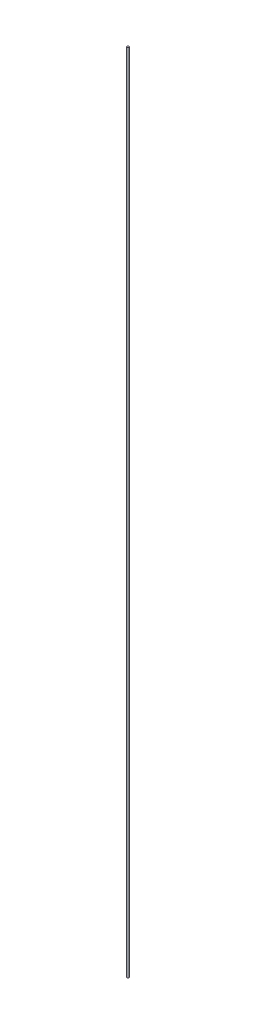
from build123d import *

# Parameters (mm, degrees)
ESQUISSE1_R      = 1.5
EXTRUSION1_DEPTH = 1180


with BuildPart() as part:
    # Esquisse1 → Extrusion1 (new body)
    with BuildSketch(Plane(origin=(0, 0, 0), x_dir=(1, 0, 0), z_dir=(0, 1, 0))):
        with Locations(Location((0, 0, 0), (0, 0, 270))):
            Circle(ESQUISSE1_R)
    extrude(amount=EXTRUSION1_DEPTH)


solid = part.part
